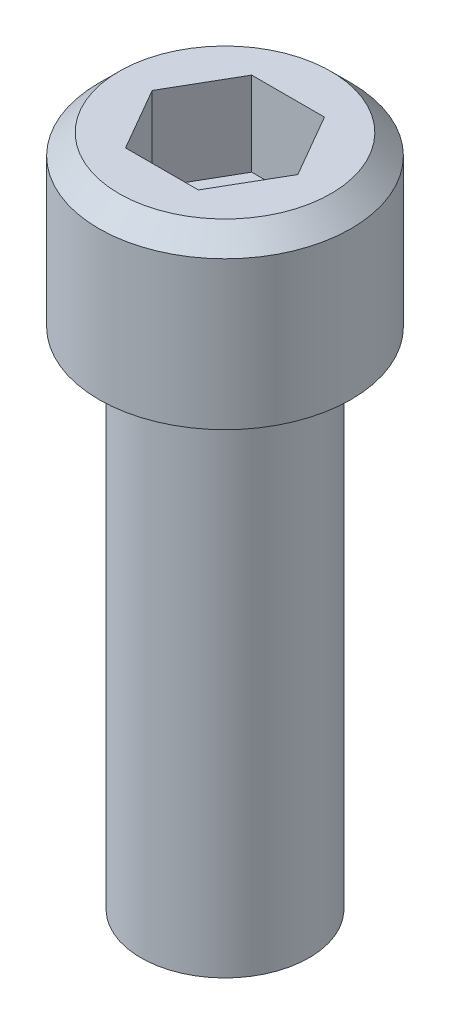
ISO-10303-21;
HEADER;
FILE_DESCRIPTION(('STEP AP214'),'2;1');
FILE_NAME('part.step','',(''),(''),'','','');
FILE_SCHEMA(('AUTOMOTIVE_DESIGN { 1 0 10303 214 1 1 1 1 }'));
ENDSEC;
DATA;
#1=APPLICATION_CONTEXT('core data for automotive mechanical design processes');
#2=APPLICATION_PROTOCOL_DEFINITION('international standard','automotive_design',2000,#1);
#3=PRODUCT_CONTEXT('',#1,'mechanical');
#4=PRODUCT('Part','Part','',(#3));
#5=PRODUCT_RELATED_PRODUCT_CATEGORY('part','',(#4));
#6=PRODUCT_DEFINITION_FORMATION('','',#4);
#7=PRODUCT_DEFINITION_CONTEXT('part definition',#1,'design');
#8=PRODUCT_DEFINITION('design','',#6,#7);
#9=PRODUCT_DEFINITION_SHAPE('','',#8);
#10=(LENGTH_UNIT() NAMED_UNIT(*) SI_UNIT(.MILLI.,.METRE.));
#11=(NAMED_UNIT(*) PLANE_ANGLE_UNIT() SI_UNIT($,.RADIAN.));
#12=(NAMED_UNIT(*) SI_UNIT($,.STERADIAN.) SOLID_ANGLE_UNIT());
#13=UNCERTAINTY_MEASURE_WITH_UNIT(LENGTH_MEASURE(1.E-05),#10,'distance_accuracy_value','');
#14=(GEOMETRIC_REPRESENTATION_CONTEXT(3) GLOBAL_UNCERTAINTY_ASSIGNED_CONTEXT((#13)) GLOBAL_UNIT_ASSIGNED_CONTEXT((#10,
#11,#12)) REPRESENTATION_CONTEXT('',''));
#15=CARTESIAN_POINT('',(0.,0.,0.));
#16=DIRECTION('',(0.,0.,1.));
#17=DIRECTION('',(1.,0.,0.));
#18=AXIS2_PLACEMENT_3D('',#15,#16,#17);
#19=CARTESIAN_POINT('',(0.,0.,0.));
#20=DIRECTION('',(0.,-1.,0.));
#21=DIRECTION('',(0.,0.,-1.));
#22=AXIS2_PLACEMENT_3D('',#19,#20,#21);
#23=CYLINDRICAL_SURFACE('',#22,9.525);
#24=CARTESIAN_POINT('',(0.,11.176,0.));
#25=DIRECTION('',(0.,1.,0.));
#26=DIRECTION('',(0.,0.,1.));
#27=AXIS2_PLACEMENT_3D('',#24,#25,#26);
#28=CIRCLE('',#27,9.525);
#29=CARTESIAN_POINT('',(0.,11.176,9.525));
#30=VERTEX_POINT('',#29);
#31=EDGE_CURVE('E39',#30,#30,#28,.F.);
#32=ORIENTED_EDGE('',*,*,#31,.T.);
#33=EDGE_LOOP('',(#32));
#34=FACE_BOUND('',#33,.T.);
#35=CARTESIAN_POINT('',(0.,0.,0.));
#36=DIRECTION('',(0.,-1.,0.));
#37=DIRECTION('',(0.,0.,-1.));
#38=AXIS2_PLACEMENT_3D('',#35,#36,#37);
#39=CIRCLE('',#38,9.525);
#40=CARTESIAN_POINT('',(0.,0.,-9.525));
#41=VERTEX_POINT('',#40);
#42=EDGE_CURVE('E134',#41,#41,#39,.T.);
#43=ORIENTED_EDGE('',*,*,#42,.F.);
#44=EDGE_LOOP('',(#43));
#45=FACE_BOUND('',#44,.T.);
#46=ADVANCED_FACE('F31',(#34,#45),#23,.T.);
#47=CARTESIAN_POINT('',(9.525,12.7,0.));
#48=DIRECTION('',(0.,1.,0.));
#49=DIRECTION('',(0.,0.,1.));
#50=AXIS2_PLACEMENT_3D('',#47,#48,#49);
#51=PLANE('',#50);
#52=CARTESIAN_POINT('',(0.,12.7,0.));
#53=DIRECTION('',(0.,1.,0.));
#54=DIRECTION('',(0.,0.,1.));
#55=AXIS2_PLACEMENT_3D('',#52,#53,#54);
#56=CIRCLE('',#55,8.00099999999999);
#57=CARTESIAN_POINT('',(0.,12.7,8.00099999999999));
#58=VERTEX_POINT('',#57);
#59=EDGE_CURVE('E11',#58,#58,#56,.T.);
#60=ORIENTED_EDGE('',*,*,#59,.T.);
#61=EDGE_LOOP('',(#60));
#62=FACE_BOUND('',#61,.T.);
#63=DIRECTION('',(1.,0.,0.));
#64=VECTOR('',#63,1.);
#65=CARTESIAN_POINT('',(-2.74963065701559,12.7,4.7625));
#66=LINE('',#65,#64);
#67=CARTESIAN_POINT('',(-2.74963065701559,12.7,4.7625));
#68=VERTEX_POINT('',#67);
#69=CARTESIAN_POINT('',(2.74963065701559,12.7,4.7625));
#70=VERTEX_POINT('',#69);
#71=EDGE_CURVE('E46',#68,#70,#66,.T.);
#72=ORIENTED_EDGE('',*,*,#71,.F.);
#73=DIRECTION('',(0.5,0.,0.866025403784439));
#74=VECTOR('',#73,1.);
#75=CARTESIAN_POINT('',(-5.49926131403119,12.7,0.));
#76=LINE('',#75,#74);
#77=CARTESIAN_POINT('',(-5.49926131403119,12.7,0.));
#78=VERTEX_POINT('',#77);
#79=EDGE_CURVE('E130',#78,#68,#76,.T.);
#80=ORIENTED_EDGE('',*,*,#79,.F.);
#81=DIRECTION('',(0.5,0.,-0.866025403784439));
#82=VECTOR('',#81,1.);
#83=CARTESIAN_POINT('',(-5.49926131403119,12.7,0.));
#84=LINE('',#83,#82);
#85=CARTESIAN_POINT('',(-2.74963065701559,12.7,-4.7625));
#86=VERTEX_POINT('',#85);
#87=EDGE_CURVE('E128',#78,#86,#84,.T.);
#88=ORIENTED_EDGE('',*,*,#87,.T.);
#89=DIRECTION('',(1.,0.,0.));
#90=VECTOR('',#89,1.);
#91=CARTESIAN_POINT('',(-2.74963065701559,12.7,-4.7625));
#92=LINE('',#91,#90);
#93=CARTESIAN_POINT('',(2.74963065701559,12.7,-4.7625));
#94=VERTEX_POINT('',#93);
#95=EDGE_CURVE('E105',#86,#94,#92,.T.);
#96=ORIENTED_EDGE('',*,*,#95,.T.);
#97=DIRECTION('',(-0.5,0.,-0.866025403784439));
#98=VECTOR('',#97,1.);
#99=CARTESIAN_POINT('',(5.49926131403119,12.7,0.));
#100=LINE('',#99,#98);
#101=CARTESIAN_POINT('',(5.49926131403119,12.7,0.));
#102=VERTEX_POINT('',#101);
#103=EDGE_CURVE('E124',#102,#94,#100,.T.);
#104=ORIENTED_EDGE('',*,*,#103,.F.);
#105=DIRECTION('',(-0.5,0.,0.866025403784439));
#106=VECTOR('',#105,1.);
#107=CARTESIAN_POINT('',(5.49926131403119,12.7,0.));
#108=LINE('',#107,#106);
#109=EDGE_CURVE('E121',#102,#70,#108,.T.);
#110=ORIENTED_EDGE('',*,*,#109,.T.);
#111=EDGE_LOOP('',(#72,#80,#88,#96,#104,#110));
#112=FACE_BOUND('',#111,.T.);
#113=ADVANCED_FACE('F161',(#62,#112),#51,.T.);
#114=CARTESIAN_POINT('',(0.,-38.1,0.));
#115=DIRECTION('',(0.,-1.,0.));
#116=DIRECTION('',(0.,0.,-1.));
#117=AXIS2_PLACEMENT_3D('',#114,#115,#116);
#118=PLANE('',#117);
#119=CARTESIAN_POINT('',(0.,-38.1,0.));
#120=DIRECTION('',(0.,-1.,0.));
#121=DIRECTION('',(0.,0.,-1.));
#122=AXIS2_PLACEMENT_3D('',#119,#120,#121);
#123=CIRCLE('',#122,6.35);
#124=CARTESIAN_POINT('',(0.,-38.1,-6.35));
#125=VERTEX_POINT('',#124);
#126=EDGE_CURVE('E145',#125,#125,#123,.T.);
#127=ORIENTED_EDGE('',*,*,#126,.T.);
#128=EDGE_LOOP('',(#127));
#129=FACE_BOUND('',#128,.T.);
#130=ADVANCED_FACE('F165',(#129),#118,.T.);
#131=CARTESIAN_POINT('',(0.,0.,0.));
#132=DIRECTION('',(0.,-1.,0.));
#133=DIRECTION('',(0.,0.,-1.));
#134=AXIS2_PLACEMENT_3D('',#131,#132,#133);
#135=CYLINDRICAL_SURFACE('',#134,6.35);
#136=CARTESIAN_POINT('',(0.,0.,0.));
#137=DIRECTION('',(0.,-1.,0.));
#138=DIRECTION('',(0.,0.,-1.));
#139=AXIS2_PLACEMENT_3D('',#136,#137,#138);
#140=CIRCLE('',#139,6.35);
#141=CARTESIAN_POINT('',(0.,0.,-6.35));
#142=VERTEX_POINT('',#141);
#143=EDGE_CURVE('E142',#142,#142,#140,.T.);
#144=ORIENTED_EDGE('',*,*,#143,.T.);
#145=EDGE_LOOP('',(#144));
#146=FACE_BOUND('',#145,.T.);
#147=ORIENTED_EDGE('',*,*,#126,.F.);
#148=EDGE_LOOP('',(#147));
#149=FACE_BOUND('',#148,.T.);
#150=ADVANCED_FACE('F171',(#146,#149),#135,.T.);
#151=CARTESIAN_POINT('',(6.35,0.,0.));
#152=DIRECTION('',(0.,-1.,0.));
#153=DIRECTION('',(0.,0.,-1.));
#154=AXIS2_PLACEMENT_3D('',#151,#152,#153);
#155=PLANE('',#154);
#156=ORIENTED_EDGE('',*,*,#42,.T.);
#157=EDGE_LOOP('',(#156));
#158=FACE_BOUND('',#157,.T.);
#159=ORIENTED_EDGE('',*,*,#143,.F.);
#160=EDGE_LOOP('',(#159));
#161=FACE_BOUND('',#160,.T.);
#162=ADVANCED_FACE('F175',(#158,#161),#155,.T.);
#163=CARTESIAN_POINT('',(-2.74963065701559,6.35,4.7625));
#164=DIRECTION('',(0.,0.,1.));
#165=DIRECTION('',(1.,0.,0.));
#166=AXIS2_PLACEMENT_3D('',#163,#164,#165);
#167=PLANE('',#166);
#168=ORIENTED_EDGE('',*,*,#71,.T.);
#169=DIRECTION('',(0.,1.,0.));
#170=VECTOR('',#169,1.);
#171=CARTESIAN_POINT('',(2.74963065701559,6.35,4.7625));
#172=LINE('',#171,#170);
#173=CARTESIAN_POINT('',(2.74963065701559,6.35,4.7625));
#174=VERTEX_POINT('',#173);
#175=EDGE_CURVE('E119',#174,#70,#172,.T.);
#176=ORIENTED_EDGE('',*,*,#175,.F.);
#177=DIRECTION('',(1.,0.,0.));
#178=VECTOR('',#177,1.);
#179=CARTESIAN_POINT('',(-2.74963065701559,6.35,4.7625));
#180=LINE('',#179,#178);
#181=CARTESIAN_POINT('',(-2.74963065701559,6.35,4.7625));
#182=VERTEX_POINT('',#181);
#183=EDGE_CURVE('E132',#182,#174,#180,.T.);
#184=ORIENTED_EDGE('',*,*,#183,.F.);
#185=DIRECTION('',(0.,1.,0.));
#186=VECTOR('',#185,1.);
#187=CARTESIAN_POINT('',(-2.74963065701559,6.35,4.7625));
#188=LINE('',#187,#186);
#189=EDGE_CURVE('E54',#182,#68,#188,.T.);
#190=ORIENTED_EDGE('',*,*,#189,.T.);
#191=EDGE_LOOP('',(#168,#176,#184,#190));
#192=FACE_BOUND('',#191,.T.);
#193=ADVANCED_FACE('F179',(#192),#167,.F.);
#194=CARTESIAN_POINT('',(-5.49926131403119,6.35,0.));
#195=DIRECTION('',(-0.866025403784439,0.,0.5));
#196=DIRECTION('',(0.5,0.,0.866025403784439));
#197=AXIS2_PLACEMENT_3D('',#194,#195,#196);
#198=PLANE('',#197);
#199=ORIENTED_EDGE('',*,*,#79,.T.);
#200=ORIENTED_EDGE('',*,*,#189,.F.);
#201=DIRECTION('',(0.5,0.,0.866025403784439));
#202=VECTOR('',#201,1.);
#203=CARTESIAN_POINT('',(-5.49926131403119,6.35,0.));
#204=LINE('',#203,#202);
#205=CARTESIAN_POINT('',(-5.49926131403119,6.35,0.));
#206=VERTEX_POINT('',#205);
#207=EDGE_CURVE('E98',#206,#182,#204,.T.);
#208=ORIENTED_EDGE('',*,*,#207,.F.);
#209=DIRECTION('',(0.,1.,0.));
#210=VECTOR('',#209,1.);
#211=CARTESIAN_POINT('',(-5.49926131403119,6.35,0.));
#212=LINE('',#211,#210);
#213=EDGE_CURVE('E94',#206,#78,#212,.T.);
#214=ORIENTED_EDGE('',*,*,#213,.T.);
#215=EDGE_LOOP('',(#199,#200,#208,#214));
#216=FACE_BOUND('',#215,.T.);
#217=ADVANCED_FACE('F183',(#216),#198,.F.);
#218=CARTESIAN_POINT('',(-5.49926131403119,6.35,0.));
#219=DIRECTION('',(0.866025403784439,0.,0.5));
#220=DIRECTION('',(0.5,0.,-0.866025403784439));
#221=AXIS2_PLACEMENT_3D('',#218,#219,#220);
#222=PLANE('',#221);
#223=ORIENTED_EDGE('',*,*,#87,.F.);
#224=ORIENTED_EDGE('',*,*,#213,.F.);
#225=DIRECTION('',(0.5,0.,-0.866025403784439));
#226=VECTOR('',#225,1.);
#227=CARTESIAN_POINT('',(-5.49926131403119,6.35,0.));
#228=LINE('',#227,#226);
#229=CARTESIAN_POINT('',(-2.74963065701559,6.35,-4.7625));
#230=VERTEX_POINT('',#229);
#231=EDGE_CURVE('E88',#206,#230,#228,.T.);
#232=ORIENTED_EDGE('',*,*,#231,.T.);
#233=DIRECTION('',(0.,1.,0.));
#234=VECTOR('',#233,1.);
#235=CARTESIAN_POINT('',(-2.74963065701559,6.35,-4.7625));
#236=LINE('',#235,#234);
#237=EDGE_CURVE('E92',#230,#86,#236,.T.);
#238=ORIENTED_EDGE('',*,*,#237,.T.);
#239=EDGE_LOOP('',(#223,#224,#232,#238));
#240=FACE_BOUND('',#239,.T.);
#241=ADVANCED_FACE('F91',(#240),#222,.T.);
#242=CARTESIAN_POINT('',(-2.74963065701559,6.35,-4.7625));
#243=DIRECTION('',(0.,0.,1.));
#244=DIRECTION('',(1.,0.,0.));
#245=AXIS2_PLACEMENT_3D('',#242,#243,#244);
#246=PLANE('',#245);
#247=ORIENTED_EDGE('',*,*,#95,.F.);
#248=ORIENTED_EDGE('',*,*,#237,.F.);
#249=DIRECTION('',(1.,0.,0.));
#250=VECTOR('',#249,1.);
#251=CARTESIAN_POINT('',(-2.74963065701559,6.35,-4.7625));
#252=LINE('',#251,#250);
#253=CARTESIAN_POINT('',(2.74963065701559,6.35,-4.7625));
#254=VERTEX_POINT('',#253);
#255=EDGE_CURVE('E99',#230,#254,#252,.T.);
#256=ORIENTED_EDGE('',*,*,#255,.T.);
#257=DIRECTION('',(0.,1.,0.));
#258=VECTOR('',#257,1.);
#259=CARTESIAN_POINT('',(2.74963065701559,6.35,-4.7625));
#260=LINE('',#259,#258);
#261=EDGE_CURVE('E107',#254,#94,#260,.T.);
#262=ORIENTED_EDGE('',*,*,#261,.T.);
#263=EDGE_LOOP('',(#247,#248,#256,#262));
#264=FACE_BOUND('',#263,.T.);
#265=ADVANCED_FACE('F102',(#264),#246,.T.);
#266=CARTESIAN_POINT('',(5.49926131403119,6.35,0.));
#267=DIRECTION('',(0.866025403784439,0.,-0.5));
#268=DIRECTION('',(-0.5,0.,-0.866025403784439));
#269=AXIS2_PLACEMENT_3D('',#266,#267,#268);
#270=PLANE('',#269);
#271=ORIENTED_EDGE('',*,*,#103,.T.);
#272=ORIENTED_EDGE('',*,*,#261,.F.);
#273=DIRECTION('',(-0.5,0.,-0.866025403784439));
#274=VECTOR('',#273,1.);
#275=CARTESIAN_POINT('',(5.49926131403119,6.35,0.));
#276=LINE('',#275,#274);
#277=CARTESIAN_POINT('',(5.49926131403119,6.35,0.));
#278=VERTEX_POINT('',#277);
#279=EDGE_CURVE('E113',#278,#254,#276,.T.);
#280=ORIENTED_EDGE('',*,*,#279,.F.);
#281=DIRECTION('',(0.,1.,0.));
#282=VECTOR('',#281,1.);
#283=CARTESIAN_POINT('',(5.49926131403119,6.35,0.));
#284=LINE('',#283,#282);
#285=EDGE_CURVE('E137',#278,#102,#284,.T.);
#286=ORIENTED_EDGE('',*,*,#285,.T.);
#287=EDGE_LOOP('',(#271,#272,#280,#286));
#288=FACE_BOUND('',#287,.T.);
#289=ADVANCED_FACE('F186',(#288),#270,.F.);
#290=CARTESIAN_POINT('',(5.49926131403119,6.35,0.));
#291=DIRECTION('',(-0.866025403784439,0.,-0.5));
#292=DIRECTION('',(-0.5,0.,0.866025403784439));
#293=AXIS2_PLACEMENT_3D('',#290,#291,#292);
#294=PLANE('',#293);
#295=ORIENTED_EDGE('',*,*,#109,.F.);
#296=ORIENTED_EDGE('',*,*,#285,.F.);
#297=DIRECTION('',(-0.5,0.,0.866025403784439));
#298=VECTOR('',#297,1.);
#299=CARTESIAN_POINT('',(5.49926131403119,6.35,0.));
#300=LINE('',#299,#298);
#301=EDGE_CURVE('E80',#278,#174,#300,.T.);
#302=ORIENTED_EDGE('',*,*,#301,.T.);
#303=ORIENTED_EDGE('',*,*,#175,.T.);
#304=EDGE_LOOP('',(#295,#296,#302,#303));
#305=FACE_BOUND('',#304,.T.);
#306=ADVANCED_FACE('F157',(#305),#294,.T.);
#307=CARTESIAN_POINT('',(2.74963065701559,6.35,4.7625));
#308=DIRECTION('',(0.,-1.,0.));
#309=DIRECTION('',(0.,0.,-1.));
#310=AXIS2_PLACEMENT_3D('',#307,#308,#309);
#311=PLANE('',#310);
#312=ORIENTED_EDGE('',*,*,#183,.T.);
#313=ORIENTED_EDGE('',*,*,#301,.F.);
#314=ORIENTED_EDGE('',*,*,#279,.T.);
#315=ORIENTED_EDGE('',*,*,#255,.F.);
#316=ORIENTED_EDGE('',*,*,#231,.F.);
#317=ORIENTED_EDGE('',*,*,#207,.T.);
#318=EDGE_LOOP('',(#312,#313,#314,#315,#316,#317));
#319=FACE_BOUND('',#318,.T.);
#320=ADVANCED_FACE('F111',(#319),#311,.F.);
#321=CARTESIAN_POINT('',(0.,11.176,0.));
#322=DIRECTION('',(0.,-1.,0.));
#323=DIRECTION('',(0.,0.,-1.));
#324=AXIS2_PLACEMENT_3D('',#321,#322,#323);
#325=CONICAL_SURFACE('',#324,9.525,0.785398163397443);
#326=ORIENTED_EDGE('',*,*,#59,.F.);
#327=EDGE_LOOP('',(#326));
#328=FACE_BOUND('',#327,.T.);
#329=ORIENTED_EDGE('',*,*,#31,.F.);
#330=EDGE_LOOP('',(#329));
#331=FACE_BOUND('',#330,.T.);
#332=ADVANCED_FACE('F33',(#328,#331),#325,.T.);
#333=CLOSED_SHELL('',(#46,#113,#130,#150,#162,#193,#217,#241,#265,#289,#306,#320,#332));
#334=MANIFOLD_SOLID_BREP('B2',#333);
#335=ADVANCED_BREP_SHAPE_REPRESENTATION('',(#18,#334),#14);
#336=SHAPE_DEFINITION_REPRESENTATION(#9,#335);
ENDSEC;
END-ISO-10303-21;
